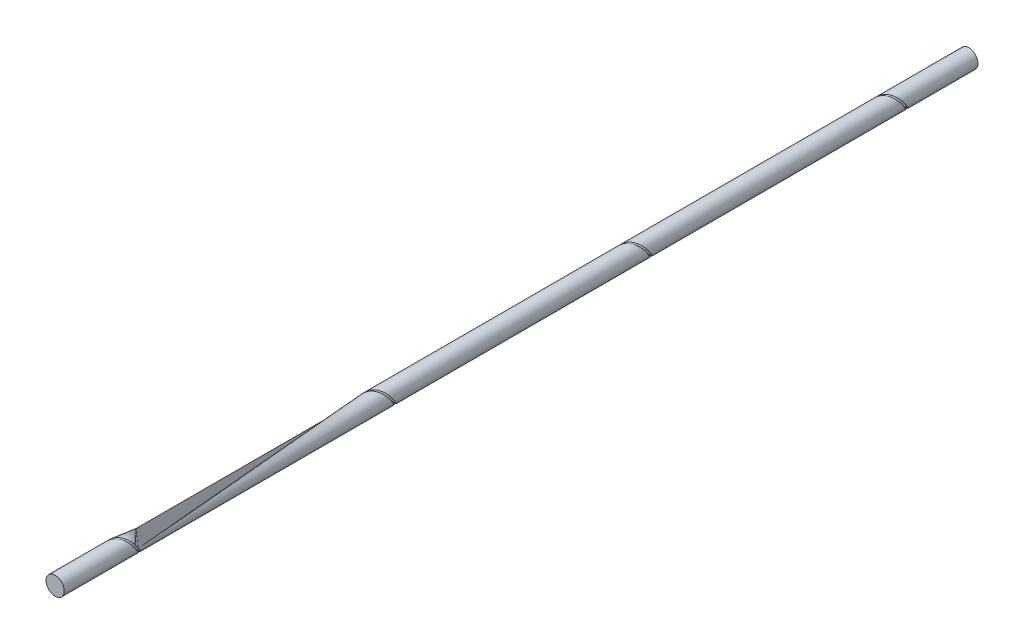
from build123d import *

# Parameters (mm, degrees)
SKETCH1_R              = 25
BOSS_EXTRUDE1_DEPTH    = 2500
CUT_SWEEP1_PITCH       = 100
CUT_SWEEP1_HEIGHT      = 100
CUT_SWEEP1_RADIUS      = 27.646
CUT_SWEEP1_START_ANGLE = -180
SKETCH3_R              = 3.969
LPATTERN1_COUNT        = 4
LPATTERN1_PITCH        = 700


with BuildPart() as part:
    # Sketch1 → Boss-Extrude1 (new body)
    with BuildSketch(Plane.XY):
        Circle(SKETCH1_R)
    extrude(amount=BOSS_EXTRUDE1_DEPTH)

    # Cut-Sweep1: sweep along a helix
    with BuildLine() as cut_sweep1_path:
        add(Helix(CUT_SWEEP1_PITCH, CUT_SWEEP1_HEIGHT, CUT_SWEEP1_RADIUS, center=(0, 0, 150), direction=(0, 0, 1), mode=Mode.PRIVATE).rotate(Axis((0, 0, 150), (0, 0, 1)), CUT_SWEEP1_START_ANGLE))
    # Sketch3 → Cut-Sweep1 (sweep, cut)
    with BuildSketch(Plane(origin=(0, 0, 0), x_dir=(1, 0, 0), z_dir=(0, 1, 0))):
        with Locations((-27.646, -150)):
            Circle(SKETCH3_R)
    cut_sweep1 = sweep(path=cut_sweep1_path.line, is_frenet=True, mode=Mode.SUBTRACT)

    # LPattern1: Cut-Sweep1 ×4
    with Locations(*[(0, 0, i * LPATTERN1_PITCH) for i in range(1, LPATTERN1_COUNT)]):
        add(cut_sweep1, mode=Mode.SUBTRACT)


solid = part.part
